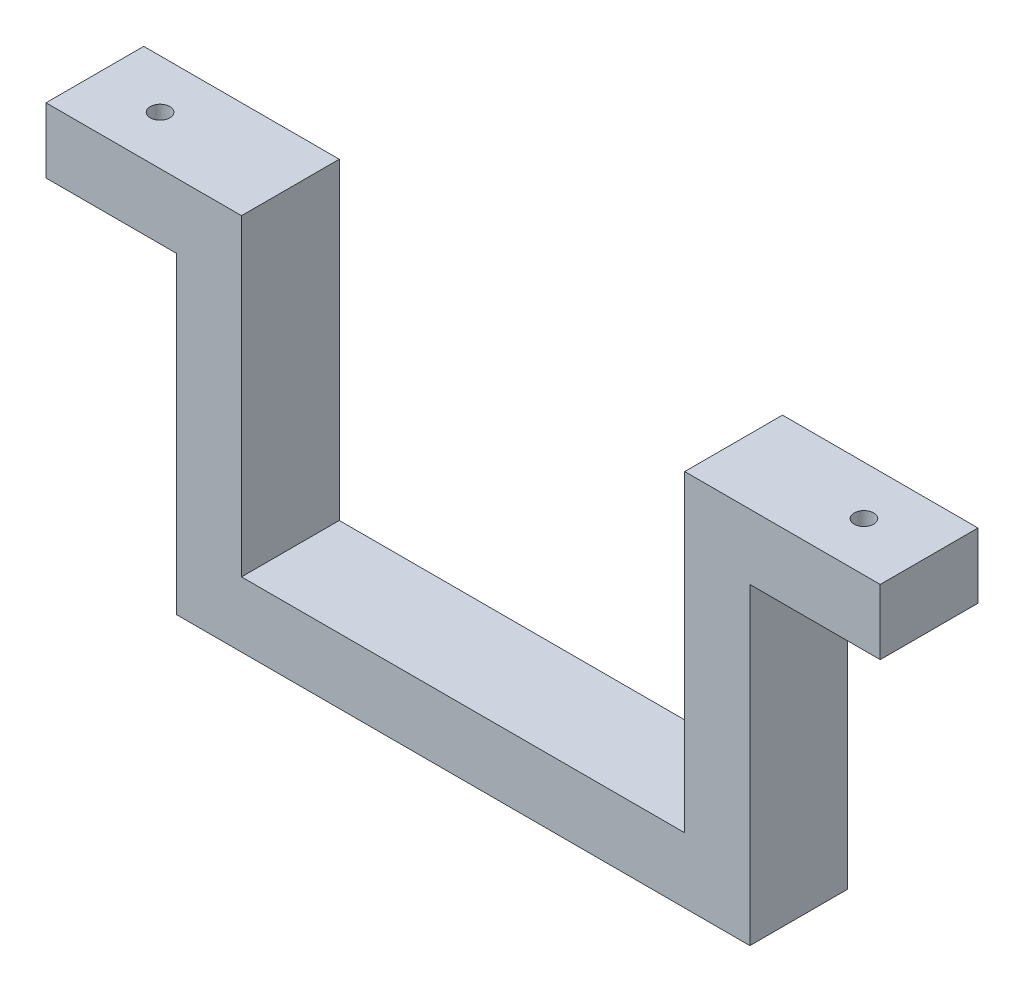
ISO-10303-21;
HEADER;
FILE_DESCRIPTION(('STEP AP214'),'2;1');
FILE_NAME('part.step','',(''),(''),'','','');
FILE_SCHEMA(('AUTOMOTIVE_DESIGN { 1 0 10303 214 1 1 1 1 }'));
ENDSEC;
DATA;
#1=APPLICATION_CONTEXT('core data for automotive mechanical design processes');
#2=APPLICATION_PROTOCOL_DEFINITION('international standard','automotive_design',2000,#1);
#3=PRODUCT_CONTEXT('',#1,'mechanical');
#4=PRODUCT('Part','Part','',(#3));
#5=PRODUCT_RELATED_PRODUCT_CATEGORY('part','',(#4));
#6=PRODUCT_DEFINITION_FORMATION('','',#4);
#7=PRODUCT_DEFINITION_CONTEXT('part definition',#1,'design');
#8=PRODUCT_DEFINITION('design','',#6,#7);
#9=PRODUCT_DEFINITION_SHAPE('','',#8);
#10=(LENGTH_UNIT() NAMED_UNIT(*) SI_UNIT(.MILLI.,.METRE.));
#11=(NAMED_UNIT(*) PLANE_ANGLE_UNIT() SI_UNIT($,.RADIAN.));
#12=(NAMED_UNIT(*) SI_UNIT($,.STERADIAN.) SOLID_ANGLE_UNIT());
#13=UNCERTAINTY_MEASURE_WITH_UNIT(LENGTH_MEASURE(1.E-05),#10,'distance_accuracy_value','');
#14=(GEOMETRIC_REPRESENTATION_CONTEXT(3) GLOBAL_UNCERTAINTY_ASSIGNED_CONTEXT((#13)) GLOBAL_UNIT_ASSIGNED_CONTEXT((#10,
#11,#12)) REPRESENTATION_CONTEXT('',''));
#15=CARTESIAN_POINT('',(0.,0.,0.));
#16=DIRECTION('',(0.,0.,1.));
#17=DIRECTION('',(1.,0.,0.));
#18=AXIS2_PLACEMENT_3D('',#15,#16,#17);
#19=CARTESIAN_POINT('',(0.,48.,15.));
#20=DIRECTION('',(1.,0.,0.));
#21=DIRECTION('',(0.,1.,0.));
#22=AXIS2_PLACEMENT_3D('',#19,#20,#21);
#23=PLANE('',#22);
#24=DIRECTION('',(0.,-1.,0.));
#25=VECTOR('',#24,1.);
#26=CARTESIAN_POINT('',(0.,48.,0.));
#27=LINE('',#26,#25);
#28=CARTESIAN_POINT('',(0.,48.,0.));
#29=VERTEX_POINT('',#28);
#30=CARTESIAN_POINT('',(0.,0.,0.));
#31=VERTEX_POINT('',#30);
#32=EDGE_CURVE('E155',#29,#31,#27,.T.);
#33=ORIENTED_EDGE('',*,*,#32,.T.);
#34=DIRECTION('',(0.,0.,-1.));
#35=VECTOR('',#34,1.);
#36=CARTESIAN_POINT('',(0.,0.,15.));
#37=LINE('',#36,#35);
#38=CARTESIAN_POINT('',(0.,0.,15.));
#39=VERTEX_POINT('',#38);
#40=EDGE_CURVE('E203',#39,#31,#37,.T.);
#41=ORIENTED_EDGE('',*,*,#40,.F.);
#42=DIRECTION('',(0.,-1.,0.));
#43=VECTOR('',#42,1.);
#44=CARTESIAN_POINT('',(0.,48.,15.));
#45=LINE('',#44,#43);
#46=CARTESIAN_POINT('',(0.,48.,15.));
#47=VERTEX_POINT('',#46);
#48=EDGE_CURVE('E178',#47,#39,#45,.T.);
#49=ORIENTED_EDGE('',*,*,#48,.F.);
#50=DIRECTION('',(0.,0.,-1.));
#51=VECTOR('',#50,1.);
#52=CARTESIAN_POINT('',(0.,48.,15.));
#53=LINE('',#52,#51);
#54=EDGE_CURVE('E151',#47,#29,#53,.T.);
#55=ORIENTED_EDGE('',*,*,#54,.T.);
#56=EDGE_LOOP('',(#33,#41,#49,#55));
#57=FACE_BOUND('',#56,.T.);
#58=ADVANCED_FACE('F33',(#57),#23,.F.);
#59=CARTESIAN_POINT('',(0.,0.,15.));
#60=DIRECTION('',(0.,1.,0.));
#61=DIRECTION('',(0.,0.,1.));
#62=AXIS2_PLACEMENT_3D('',#59,#60,#61);
#63=PLANE('',#62);
#64=DIRECTION('',(1.,0.,0.));
#65=VECTOR('',#64,1.);
#66=CARTESIAN_POINT('',(0.,0.,0.));
#67=LINE('',#66,#65);
#68=CARTESIAN_POINT('',(88.,0.,0.));
#69=VERTEX_POINT('',#68);
#70=EDGE_CURVE('E158',#31,#69,#67,.T.);
#71=ORIENTED_EDGE('',*,*,#70,.T.);
#72=DIRECTION('',(0.,0.,-1.));
#73=VECTOR('',#72,1.);
#74=CARTESIAN_POINT('',(88.,0.,15.));
#75=LINE('',#74,#73);
#76=CARTESIAN_POINT('',(88.,0.,15.));
#77=VERTEX_POINT('',#76);
#78=EDGE_CURVE('E200',#77,#69,#75,.T.);
#79=ORIENTED_EDGE('',*,*,#78,.F.);
#80=DIRECTION('',(1.,0.,0.));
#81=VECTOR('',#80,1.);
#82=CARTESIAN_POINT('',(0.,0.,15.));
#83=LINE('',#82,#81);
#84=EDGE_CURVE('E106',#39,#77,#83,.T.);
#85=ORIENTED_EDGE('',*,*,#84,.F.);
#86=ORIENTED_EDGE('',*,*,#40,.T.);
#87=EDGE_LOOP('',(#71,#79,#85,#86));
#88=FACE_BOUND('',#87,.T.);
#89=ADVANCED_FACE('F225',(#88),#63,.F.);
#90=CARTESIAN_POINT('',(88.,0.,15.));
#91=DIRECTION('',(-1.,0.,0.));
#92=DIRECTION('',(0.,0.,1.));
#93=AXIS2_PLACEMENT_3D('',#90,#91,#92);
#94=PLANE('',#93);
#95=DIRECTION('',(0.,1.,0.));
#96=VECTOR('',#95,1.);
#97=CARTESIAN_POINT('',(88.,0.,0.));
#98=LINE('',#97,#96);
#99=CARTESIAN_POINT('',(88.,48.,0.));
#100=VERTEX_POINT('',#99);
#101=EDGE_CURVE('E161',#69,#100,#98,.T.);
#102=ORIENTED_EDGE('',*,*,#101,.T.);
#103=DIRECTION('',(0.,0.,-1.));
#104=VECTOR('',#103,1.);
#105=CARTESIAN_POINT('',(88.,48.,15.));
#106=LINE('',#105,#104);
#107=CARTESIAN_POINT('',(88.,48.,15.));
#108=VERTEX_POINT('',#107);
#109=EDGE_CURVE('E197',#108,#100,#106,.T.);
#110=ORIENTED_EDGE('',*,*,#109,.F.);
#111=DIRECTION('',(0.,1.,0.));
#112=VECTOR('',#111,1.);
#113=CARTESIAN_POINT('',(88.,0.,15.));
#114=LINE('',#113,#112);
#115=EDGE_CURVE('E257',#77,#108,#114,.T.);
#116=ORIENTED_EDGE('',*,*,#115,.F.);
#117=ORIENTED_EDGE('',*,*,#78,.T.);
#118=EDGE_LOOP('',(#102,#110,#116,#117));
#119=FACE_BOUND('',#118,.T.);
#120=ADVANCED_FACE('F231',(#119),#94,.F.);
#121=CARTESIAN_POINT('',(88.,48.,15.));
#122=DIRECTION('',(0.,1.,0.));
#123=DIRECTION('',(0.,0.,1.));
#124=AXIS2_PLACEMENT_3D('',#121,#122,#123);
#125=PLANE('',#124);
#126=CARTESIAN_POINT('',(98.,48.,7.5));
#127=DIRECTION('',(0.,1.,0.));
#128=DIRECTION('',(0.,0.,1.));
#129=AXIS2_PLACEMENT_3D('',#126,#127,#128);
#130=CIRCLE('',#129,4.50000000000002);
#131=CARTESIAN_POINT('',(98.,48.,2.99999999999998));
#132=VERTEX_POINT('',#131);
#133=EDGE_CURVE('E208',#132,#132,#130,.T.);
#134=ORIENTED_EDGE('',*,*,#133,.T.);
#135=EDGE_LOOP('',(#134));
#136=FACE_BOUND('',#135,.T.);
#137=DIRECTION('',(1.,0.,0.));
#138=VECTOR('',#137,1.);
#139=CARTESIAN_POINT('',(88.,48.,0.));
#140=LINE('',#139,#138);
#141=CARTESIAN_POINT('',(108.,48.,0.));
#142=VERTEX_POINT('',#141);
#143=EDGE_CURVE('E163',#100,#142,#140,.T.);
#144=ORIENTED_EDGE('',*,*,#143,.T.);
#145=DIRECTION('',(0.,0.,-1.));
#146=VECTOR('',#145,1.);
#147=CARTESIAN_POINT('',(108.,48.,15.));
#148=LINE('',#147,#146);
#149=CARTESIAN_POINT('',(108.,48.,15.));
#150=VERTEX_POINT('',#149);
#151=EDGE_CURVE('E194',#150,#142,#148,.T.);
#152=ORIENTED_EDGE('',*,*,#151,.F.);
#153=DIRECTION('',(1.,0.,0.));
#154=VECTOR('',#153,1.);
#155=CARTESIAN_POINT('',(88.,48.,15.));
#156=LINE('',#155,#154);
#157=EDGE_CURVE('E259',#108,#150,#156,.T.);
#158=ORIENTED_EDGE('',*,*,#157,.F.);
#159=ORIENTED_EDGE('',*,*,#109,.T.);
#160=EDGE_LOOP('',(#144,#152,#158,#159));
#161=FACE_BOUND('',#160,.T.);
#162=ADVANCED_FACE('F312',(#136,#161),#125,.F.);
#163=CARTESIAN_POINT('',(108.,48.,15.));
#164=DIRECTION('',(-1.,0.,0.));
#165=DIRECTION('',(0.,0.,1.));
#166=AXIS2_PLACEMENT_3D('',#163,#164,#165);
#167=PLANE('',#166);
#168=DIRECTION('',(0.,1.,0.));
#169=VECTOR('',#168,1.);
#170=CARTESIAN_POINT('',(108.,48.,0.));
#171=LINE('',#170,#169);
#172=CARTESIAN_POINT('',(108.,58.,0.));
#173=VERTEX_POINT('',#172);
#174=EDGE_CURVE('E165',#142,#173,#171,.T.);
#175=ORIENTED_EDGE('',*,*,#174,.T.);
#176=DIRECTION('',(0.,0.,-1.));
#177=VECTOR('',#176,1.);
#178=CARTESIAN_POINT('',(108.,58.,15.));
#179=LINE('',#178,#177);
#180=CARTESIAN_POINT('',(108.,58.,15.));
#181=VERTEX_POINT('',#180);
#182=EDGE_CURVE('E191',#181,#173,#179,.T.);
#183=ORIENTED_EDGE('',*,*,#182,.F.);
#184=DIRECTION('',(0.,1.,0.));
#185=VECTOR('',#184,1.);
#186=CARTESIAN_POINT('',(108.,48.,15.));
#187=LINE('',#186,#185);
#188=EDGE_CURVE('E261',#150,#181,#187,.T.);
#189=ORIENTED_EDGE('',*,*,#188,.F.);
#190=ORIENTED_EDGE('',*,*,#151,.T.);
#191=EDGE_LOOP('',(#175,#183,#189,#190));
#192=FACE_BOUND('',#191,.T.);
#193=ADVANCED_FACE('F309',(#192),#167,.F.);
#194=CARTESIAN_POINT('',(108.,58.,15.));
#195=DIRECTION('',(0.,-1.,0.));
#196=DIRECTION('',(1.,0.,0.));
#197=AXIS2_PLACEMENT_3D('',#194,#195,#196);
#198=PLANE('',#197);
#199=CARTESIAN_POINT('',(98.,58.,7.5));
#200=DIRECTION('',(0.,-1.,0.));
#201=DIRECTION('',(0.,0.,-1.));
#202=AXIS2_PLACEMENT_3D('',#199,#200,#201);
#203=CIRCLE('',#202,1.5);
#204=CARTESIAN_POINT('',(98.,58.,6.));
#205=VERTEX_POINT('',#204);
#206=EDGE_CURVE('E159',#205,#205,#203,.T.);
#207=ORIENTED_EDGE('',*,*,#206,.T.);
#208=EDGE_LOOP('',(#207));
#209=FACE_BOUND('',#208,.T.);
#210=DIRECTION('',(-1.,0.,0.));
#211=VECTOR('',#210,1.);
#212=CARTESIAN_POINT('',(108.,58.,0.));
#213=LINE('',#212,#211);
#214=CARTESIAN_POINT('',(78.,58.,0.));
#215=VERTEX_POINT('',#214);
#216=EDGE_CURVE('E167',#173,#215,#213,.T.);
#217=ORIENTED_EDGE('',*,*,#216,.T.);
#218=DIRECTION('',(0.,0.,-1.));
#219=VECTOR('',#218,1.);
#220=CARTESIAN_POINT('',(78.,58.,15.));
#221=LINE('',#220,#219);
#222=CARTESIAN_POINT('',(78.,58.,15.));
#223=VERTEX_POINT('',#222);
#224=EDGE_CURVE('E188',#223,#215,#221,.T.);
#225=ORIENTED_EDGE('',*,*,#224,.F.);
#226=DIRECTION('',(-1.,0.,0.));
#227=VECTOR('',#226,1.);
#228=CARTESIAN_POINT('',(108.,58.,15.));
#229=LINE('',#228,#227);
#230=EDGE_CURVE('E263',#181,#223,#229,.T.);
#231=ORIENTED_EDGE('',*,*,#230,.F.);
#232=ORIENTED_EDGE('',*,*,#182,.T.);
#233=EDGE_LOOP('',(#217,#225,#231,#232));
#234=FACE_BOUND('',#233,.T.);
#235=ADVANCED_FACE('F305',(#209,#234),#198,.F.);
#236=CARTESIAN_POINT('',(78.,58.,15.));
#237=DIRECTION('',(1.,0.,0.));
#238=DIRECTION('',(0.,0.,-1.));
#239=AXIS2_PLACEMENT_3D('',#236,#237,#238);
#240=PLANE('',#239);
#241=DIRECTION('',(0.,-1.,0.));
#242=VECTOR('',#241,1.);
#243=CARTESIAN_POINT('',(78.,58.,0.));
#244=LINE('',#243,#242);
#245=CARTESIAN_POINT('',(78.,10.,0.));
#246=VERTEX_POINT('',#245);
#247=EDGE_CURVE('E169',#215,#246,#244,.T.);
#248=ORIENTED_EDGE('',*,*,#247,.T.);
#249=DIRECTION('',(0.,0.,-1.));
#250=VECTOR('',#249,1.);
#251=CARTESIAN_POINT('',(78.,10.,15.));
#252=LINE('',#251,#250);
#253=CARTESIAN_POINT('',(78.,10.,15.));
#254=VERTEX_POINT('',#253);
#255=EDGE_CURVE('E185',#254,#246,#252,.T.);
#256=ORIENTED_EDGE('',*,*,#255,.F.);
#257=DIRECTION('',(0.,-1.,0.));
#258=VECTOR('',#257,1.);
#259=CARTESIAN_POINT('',(78.,58.,15.));
#260=LINE('',#259,#258);
#261=EDGE_CURVE('E265',#223,#254,#260,.T.);
#262=ORIENTED_EDGE('',*,*,#261,.F.);
#263=ORIENTED_EDGE('',*,*,#224,.T.);
#264=EDGE_LOOP('',(#248,#256,#262,#263));
#265=FACE_BOUND('',#264,.T.);
#266=ADVANCED_FACE('F302',(#265),#240,.F.);
#267=CARTESIAN_POINT('',(78.,10.,15.));
#268=DIRECTION('',(0.,-1.,0.));
#269=DIRECTION('',(1.,0.,0.));
#270=AXIS2_PLACEMENT_3D('',#267,#268,#269);
#271=PLANE('',#270);
#272=DIRECTION('',(-1.,0.,0.));
#273=VECTOR('',#272,1.);
#274=CARTESIAN_POINT('',(78.,10.,0.));
#275=LINE('',#274,#273);
#276=CARTESIAN_POINT('',(10.,9.99999999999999,0.));
#277=VERTEX_POINT('',#276);
#278=EDGE_CURVE('E171',#246,#277,#275,.T.);
#279=ORIENTED_EDGE('',*,*,#278,.T.);
#280=DIRECTION('',(0.,0.,-1.));
#281=VECTOR('',#280,1.);
#282=CARTESIAN_POINT('',(10.,9.99999999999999,15.));
#283=LINE('',#282,#281);
#284=CARTESIAN_POINT('',(10.,9.99999999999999,15.));
#285=VERTEX_POINT('',#284);
#286=EDGE_CURVE('E182',#285,#277,#283,.T.);
#287=ORIENTED_EDGE('',*,*,#286,.F.);
#288=DIRECTION('',(-1.,0.,0.));
#289=VECTOR('',#288,1.);
#290=CARTESIAN_POINT('',(78.,10.,15.));
#291=LINE('',#290,#289);
#292=EDGE_CURVE('E267',#254,#285,#291,.T.);
#293=ORIENTED_EDGE('',*,*,#292,.F.);
#294=ORIENTED_EDGE('',*,*,#255,.T.);
#295=EDGE_LOOP('',(#279,#287,#293,#294));
#296=FACE_BOUND('',#295,.T.);
#297=ADVANCED_FACE('F273',(#296),#271,.F.);
#298=CARTESIAN_POINT('',(10.,9.99999999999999,15.));
#299=DIRECTION('',(-1.,0.,0.));
#300=DIRECTION('',(0.,0.,1.));
#301=AXIS2_PLACEMENT_3D('',#298,#299,#300);
#302=PLANE('',#301);
#303=DIRECTION('',(0.,1.,0.));
#304=VECTOR('',#303,1.);
#305=CARTESIAN_POINT('',(10.,9.99999999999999,0.));
#306=LINE('',#305,#304);
#307=CARTESIAN_POINT('',(10.,58.,0.));
#308=VERTEX_POINT('',#307);
#309=EDGE_CURVE('E173',#277,#308,#306,.T.);
#310=ORIENTED_EDGE('',*,*,#309,.T.);
#311=DIRECTION('',(0.,0.,-1.));
#312=VECTOR('',#311,1.);
#313=CARTESIAN_POINT('',(10.,58.,15.));
#314=LINE('',#313,#312);
#315=CARTESIAN_POINT('',(10.,58.,15.));
#316=VERTEX_POINT('',#315);
#317=EDGE_CURVE('E146',#316,#308,#314,.T.);
#318=ORIENTED_EDGE('',*,*,#317,.F.);
#319=DIRECTION('',(0.,1.,0.));
#320=VECTOR('',#319,1.);
#321=CARTESIAN_POINT('',(10.,9.99999999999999,15.));
#322=LINE('',#321,#320);
#323=EDGE_CURVE('E137',#285,#316,#322,.T.);
#324=ORIENTED_EDGE('',*,*,#323,.F.);
#325=ORIENTED_EDGE('',*,*,#286,.T.);
#326=EDGE_LOOP('',(#310,#318,#324,#325));
#327=FACE_BOUND('',#326,.T.);
#328=ADVANCED_FACE('F277',(#327),#302,.F.);
#329=CARTESIAN_POINT('',(10.,58.,15.));
#330=DIRECTION('',(0.,-1.,0.));
#331=DIRECTION('',(1.,0.,0.));
#332=AXIS2_PLACEMENT_3D('',#329,#330,#331);
#333=PLANE('',#332);
#334=CARTESIAN_POINT('',(-10.,58.,7.5));
#335=DIRECTION('',(0.,-1.,0.));
#336=DIRECTION('',(0.,0.,-1.));
#337=AXIS2_PLACEMENT_3D('',#334,#335,#336);
#338=CIRCLE('',#337,1.5);
#339=CARTESIAN_POINT('',(-10.,58.,6.));
#340=VERTEX_POINT('',#339);
#341=EDGE_CURVE('E250',#340,#340,#338,.T.);
#342=ORIENTED_EDGE('',*,*,#341,.T.);
#343=EDGE_LOOP('',(#342));
#344=FACE_BOUND('',#343,.T.);
#345=DIRECTION('',(-1.,0.,0.));
#346=VECTOR('',#345,1.);
#347=CARTESIAN_POINT('',(10.,58.,0.));
#348=LINE('',#347,#346);
#349=CARTESIAN_POINT('',(-20.,58.,0.));
#350=VERTEX_POINT('',#349);
#351=EDGE_CURVE('E145',#308,#350,#348,.T.);
#352=ORIENTED_EDGE('',*,*,#351,.T.);
#353=DIRECTION('',(0.,0.,-1.));
#354=VECTOR('',#353,1.);
#355=CARTESIAN_POINT('',(-20.,58.,15.));
#356=LINE('',#355,#354);
#357=CARTESIAN_POINT('',(-20.,58.,15.));
#358=VERTEX_POINT('',#357);
#359=EDGE_CURVE('E142',#358,#350,#356,.T.);
#360=ORIENTED_EDGE('',*,*,#359,.F.);
#361=DIRECTION('',(-1.,0.,0.));
#362=VECTOR('',#361,1.);
#363=CARTESIAN_POINT('',(10.,58.,15.));
#364=LINE('',#363,#362);
#365=EDGE_CURVE('E131',#316,#358,#364,.T.);
#366=ORIENTED_EDGE('',*,*,#365,.F.);
#367=ORIENTED_EDGE('',*,*,#317,.T.);
#368=EDGE_LOOP('',(#352,#360,#366,#367));
#369=FACE_BOUND('',#368,.T.);
#370=ADVANCED_FACE('F143',(#344,#369),#333,.F.);
#371=CARTESIAN_POINT('',(-20.,58.,15.));
#372=DIRECTION('',(1.,0.,0.));
#373=DIRECTION('',(0.,0.,-1.));
#374=AXIS2_PLACEMENT_3D('',#371,#372,#373);
#375=PLANE('',#374);
#376=DIRECTION('',(0.,-1.,0.));
#377=VECTOR('',#376,1.);
#378=CARTESIAN_POINT('',(-20.,58.,0.));
#379=LINE('',#378,#377);
#380=CARTESIAN_POINT('',(-20.,48.,0.));
#381=VERTEX_POINT('',#380);
#382=EDGE_CURVE('E91',#350,#381,#379,.T.);
#383=ORIENTED_EDGE('',*,*,#382,.T.);
#384=DIRECTION('',(0.,0.,-1.));
#385=VECTOR('',#384,1.);
#386=CARTESIAN_POINT('',(-20.,48.,15.));
#387=LINE('',#386,#385);
#388=CARTESIAN_POINT('',(-20.,48.,15.));
#389=VERTEX_POINT('',#388);
#390=EDGE_CURVE('E147',#389,#381,#387,.T.);
#391=ORIENTED_EDGE('',*,*,#390,.F.);
#392=DIRECTION('',(0.,-1.,0.));
#393=VECTOR('',#392,1.);
#394=CARTESIAN_POINT('',(-20.,58.,15.));
#395=LINE('',#394,#393);
#396=EDGE_CURVE('E135',#358,#389,#395,.T.);
#397=ORIENTED_EDGE('',*,*,#396,.F.);
#398=ORIENTED_EDGE('',*,*,#359,.T.);
#399=EDGE_LOOP('',(#383,#391,#397,#398));
#400=FACE_BOUND('',#399,.T.);
#401=ADVANCED_FACE('F149',(#400),#375,.F.);
#402=CARTESIAN_POINT('',(-20.,48.,15.));
#403=DIRECTION('',(0.,1.,0.));
#404=DIRECTION('',(0.,0.,1.));
#405=AXIS2_PLACEMENT_3D('',#402,#403,#404);
#406=PLANE('',#405);
#407=CARTESIAN_POINT('',(-10.,48.,7.5));
#408=DIRECTION('',(0.,1.,0.));
#409=DIRECTION('',(0.,0.,1.));
#410=AXIS2_PLACEMENT_3D('',#407,#408,#409);
#411=CIRCLE('',#410,4.5);
#412=CARTESIAN_POINT('',(-10.,48.,2.99999999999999));
#413=VERTEX_POINT('',#412);
#414=EDGE_CURVE('E11',#413,#413,#411,.T.);
#415=ORIENTED_EDGE('',*,*,#414,.T.);
#416=EDGE_LOOP('',(#415));
#417=FACE_BOUND('',#416,.T.);
#418=DIRECTION('',(1.,0.,0.));
#419=VECTOR('',#418,1.);
#420=CARTESIAN_POINT('',(-20.,48.,0.));
#421=LINE('',#420,#419);
#422=EDGE_CURVE('E97',#381,#29,#421,.T.);
#423=ORIENTED_EDGE('',*,*,#422,.T.);
#424=ORIENTED_EDGE('',*,*,#54,.F.);
#425=DIRECTION('',(1.,0.,0.));
#426=VECTOR('',#425,1.);
#427=CARTESIAN_POINT('',(-20.,48.,15.));
#428=LINE('',#427,#426);
#429=EDGE_CURVE('E50',#389,#47,#428,.T.);
#430=ORIENTED_EDGE('',*,*,#429,.F.);
#431=ORIENTED_EDGE('',*,*,#390,.T.);
#432=EDGE_LOOP('',(#423,#424,#430,#431));
#433=FACE_BOUND('',#432,.T.);
#434=ADVANCED_FACE('F283',(#417,#433),#406,.F.);
#435=CARTESIAN_POINT('',(0.,0.,15.));
#436=DIRECTION('',(0.,0.,1.));
#437=DIRECTION('',(1.,0.,0.));
#438=AXIS2_PLACEMENT_3D('',#435,#436,#437);
#439=PLANE('',#438);
#440=ORIENTED_EDGE('',*,*,#48,.T.);
#441=ORIENTED_EDGE('',*,*,#84,.T.);
#442=ORIENTED_EDGE('',*,*,#115,.T.);
#443=ORIENTED_EDGE('',*,*,#157,.T.);
#444=ORIENTED_EDGE('',*,*,#188,.T.);
#445=ORIENTED_EDGE('',*,*,#230,.T.);
#446=ORIENTED_EDGE('',*,*,#261,.T.);
#447=ORIENTED_EDGE('',*,*,#292,.T.);
#448=ORIENTED_EDGE('',*,*,#323,.T.);
#449=ORIENTED_EDGE('',*,*,#365,.T.);
#450=ORIENTED_EDGE('',*,*,#396,.T.);
#451=ORIENTED_EDGE('',*,*,#429,.T.);
#452=EDGE_LOOP('',(#440,#441,#442,#443,#444,#445,#446,#447,#448,#449,#450,#451));
#453=FACE_BOUND('',#452,.T.);
#454=ADVANCED_FACE('F133',(#453),#439,.T.);
#455=CARTESIAN_POINT('',(0.,0.,0.));
#456=DIRECTION('',(0.,0.,1.));
#457=DIRECTION('',(1.,0.,0.));
#458=AXIS2_PLACEMENT_3D('',#455,#456,#457);
#459=PLANE('',#458);
#460=ORIENTED_EDGE('',*,*,#32,.F.);
#461=ORIENTED_EDGE('',*,*,#422,.F.);
#462=ORIENTED_EDGE('',*,*,#382,.F.);
#463=ORIENTED_EDGE('',*,*,#351,.F.);
#464=ORIENTED_EDGE('',*,*,#309,.F.);
#465=ORIENTED_EDGE('',*,*,#278,.F.);
#466=ORIENTED_EDGE('',*,*,#247,.F.);
#467=ORIENTED_EDGE('',*,*,#216,.F.);
#468=ORIENTED_EDGE('',*,*,#174,.F.);
#469=ORIENTED_EDGE('',*,*,#143,.F.);
#470=ORIENTED_EDGE('',*,*,#101,.F.);
#471=ORIENTED_EDGE('',*,*,#70,.F.);
#472=EDGE_LOOP('',(#460,#461,#462,#463,#464,#465,#466,#467,#468,#469,#470,#471));
#473=FACE_BOUND('',#472,.T.);
#474=ADVANCED_FACE('F240',(#473),#459,.F.);
#475=CARTESIAN_POINT('',(98.,58.,7.5));
#476=DIRECTION('',(0.,-1.,0.));
#477=DIRECTION('',(0.,0.,-1.));
#478=AXIS2_PLACEMENT_3D('',#475,#476,#477);
#479=CYLINDRICAL_SURFACE('',#478,1.5);
#480=CARTESIAN_POINT('',(98.,51.,7.5));
#481=DIRECTION('',(0.,1.,0.));
#482=DIRECTION('',(0.,0.,1.));
#483=AXIS2_PLACEMENT_3D('',#480,#481,#482);
#484=CIRCLE('',#483,1.5);
#485=CARTESIAN_POINT('',(98.,51.,6.));
#486=VERTEX_POINT('',#485);
#487=EDGE_CURVE('E205',#486,#486,#484,.F.);
#488=ORIENTED_EDGE('',*,*,#487,.T.);
#489=EDGE_LOOP('',(#488));
#490=FACE_BOUND('',#489,.T.);
#491=ORIENTED_EDGE('',*,*,#206,.F.);
#492=EDGE_LOOP('',(#491));
#493=FACE_BOUND('',#492,.T.);
#494=ADVANCED_FACE('F235',(#490,#493),#479,.F.);
#495=CARTESIAN_POINT('',(98.,51.,7.5));
#496=DIRECTION('',(0.,-1.,0.));
#497=DIRECTION('',(0.,0.,-1.));
#498=AXIS2_PLACEMENT_3D('',#495,#496,#497);
#499=CONICAL_SURFACE('',#498,1.5,0.785398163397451);
#500=CARTESIAN_POINT('',(98.,48.,2.99999999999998));
#501=CARTESIAN_POINT('',(98.,48.03125,3.03124999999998));
#502=CARTESIAN_POINT('',(98.,48.0625,3.06249999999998));
#503=CARTESIAN_POINT('',(98.,48.125,3.12499999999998));
#504=CARTESIAN_POINT('',(98.,48.15625,3.15624999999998));
#505=CARTESIAN_POINT('',(98.,48.21875,3.21874999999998));
#506=CARTESIAN_POINT('',(98.,48.25,3.24999999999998));
#507=CARTESIAN_POINT('',(98.,48.3125,3.31249999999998));
#508=CARTESIAN_POINT('',(98.,48.34375,3.34374999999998));
#509=CARTESIAN_POINT('',(98.,48.40625,3.40624999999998));
#510=CARTESIAN_POINT('',(98.,48.4375,3.43749999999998));
#511=CARTESIAN_POINT('',(98.,48.5,3.49999999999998));
#512=CARTESIAN_POINT('',(98.,48.53125,3.53124999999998));
#513=CARTESIAN_POINT('',(98.,48.59375,3.59374999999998));
#514=CARTESIAN_POINT('',(98.,48.625,3.62499999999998));
#515=CARTESIAN_POINT('',(98.,48.6875,3.68749999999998));
#516=CARTESIAN_POINT('',(98.,48.71875,3.71874999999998));
#517=CARTESIAN_POINT('',(98.,48.78125,3.78124999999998));
#518=CARTESIAN_POINT('',(98.,48.8125,3.81249999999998));
#519=CARTESIAN_POINT('',(98.,48.875,3.87499999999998));
#520=CARTESIAN_POINT('',(98.,48.90625,3.90624999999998));
#521=CARTESIAN_POINT('',(98.,48.96875,3.96874999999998));
#522=CARTESIAN_POINT('',(98.,49.,3.99999999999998));
#523=CARTESIAN_POINT('',(98.,49.0625,4.06249999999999));
#524=CARTESIAN_POINT('',(98.,49.09375,4.09374999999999));
#525=CARTESIAN_POINT('',(98.,49.15625,4.15624999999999));
#526=CARTESIAN_POINT('',(98.,49.1875,4.18749999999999));
#527=CARTESIAN_POINT('',(98.,49.25,4.24999999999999));
#528=CARTESIAN_POINT('',(98.,49.28125,4.28124999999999));
#529=CARTESIAN_POINT('',(98.,49.34375,4.34374999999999));
#530=CARTESIAN_POINT('',(98.,49.375,4.37499999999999));
#531=CARTESIAN_POINT('',(98.,49.4375,4.43749999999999));
#532=CARTESIAN_POINT('',(98.,49.46875,4.46874999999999));
#533=CARTESIAN_POINT('',(98.,49.53125,4.53124999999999));
#534=CARTESIAN_POINT('',(98.,49.5625,4.56249999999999));
#535=CARTESIAN_POINT('',(98.,49.625,4.62499999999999));
#536=CARTESIAN_POINT('',(98.,49.65625,4.65624999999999));
#537=CARTESIAN_POINT('',(98.,49.71875,4.71874999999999));
#538=CARTESIAN_POINT('',(98.,49.75,4.74999999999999));
#539=CARTESIAN_POINT('',(98.,49.8125,4.81249999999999));
#540=CARTESIAN_POINT('',(98.,49.84375,4.84374999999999));
#541=CARTESIAN_POINT('',(98.,49.90625,4.90624999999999));
#542=CARTESIAN_POINT('',(98.,49.9375,4.93749999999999));
#543=CARTESIAN_POINT('',(98.,50.,4.99999999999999));
#544=CARTESIAN_POINT('',(98.,50.03125,5.03124999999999));
#545=CARTESIAN_POINT('',(98.,50.09375,5.09374999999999));
#546=CARTESIAN_POINT('',(98.,50.125,5.12499999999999));
#547=CARTESIAN_POINT('',(98.,50.1875,5.18749999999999));
#548=CARTESIAN_POINT('',(98.,50.21875,5.21874999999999));
#549=CARTESIAN_POINT('',(98.,50.28125,5.28125));
#550=CARTESIAN_POINT('',(98.,50.3125,5.31249999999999));
#551=CARTESIAN_POINT('',(98.,50.375,5.37499999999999));
#552=CARTESIAN_POINT('',(98.,50.40625,5.40624999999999));
#553=CARTESIAN_POINT('',(98.,50.46875,5.46874999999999));
#554=CARTESIAN_POINT('',(98.,50.5,5.49999999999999));
#555=CARTESIAN_POINT('',(98.,50.5625,5.5625));
#556=CARTESIAN_POINT('',(98.,50.59375,5.59375));
#557=CARTESIAN_POINT('',(98.,50.65625,5.65625));
#558=CARTESIAN_POINT('',(98.,50.6875,5.6875));
#559=CARTESIAN_POINT('',(98.,50.75,5.75));
#560=CARTESIAN_POINT('',(98.,50.78125,5.78125));
#561=CARTESIAN_POINT('',(98.,50.84375,5.84375));
#562=CARTESIAN_POINT('',(98.,50.875,5.875));
#563=CARTESIAN_POINT('',(98.,50.9375,5.9375));
#564=CARTESIAN_POINT('',(98.,50.96875,5.96875));
#565=CARTESIAN_POINT('',(98.,51.,6.));
#566=B_SPLINE_CURVE_WITH_KNOTS('',3,(#500,#501,#502,#503,#504,#505,#506,#507,#508,#509,#510,
#511,#512,#513,#514,#515,#516,#517,#518,#519,#520,#521,#522,#523,#524,#525,#526,#527,#528,#529,
#530,#531,#532,#533,#534,#535,#536,#537,#538,#539,#540,#541,#542,#543,#544,#545,#546,#547,#548,
#549,#550,#551,#552,#553,#554,#555,#556,#557,#558,#559,#560,#561,#562,#563,#564,#565),
.UNSPECIFIED.,.F.,.F.,(4,2,2,2,2,2,2,2,2,2,2,2,2,2,2,2,2,2,2,2,2,2,2,2,2,2,2,2,2,2,2,2,4),(0.,
0.13258252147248,0.265165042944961,0.397747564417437,0.530330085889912,0.662912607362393,
0.795495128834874,0.92807765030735,1.06066017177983,1.19324269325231,1.32582521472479,
1.45840773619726,1.59099025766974,1.72357277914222,1.8561553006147,1.98873782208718,
2.12132034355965,2.25390286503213,2.38648538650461,2.51906790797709,2.65165042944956,
2.78423295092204,2.91681547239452,3.049397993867,3.18198051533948,3.31456303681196,
3.44714555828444,3.57972807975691,3.71231060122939,3.84489312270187,3.97747564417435,
4.11005816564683,4.2426406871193),.UNSPECIFIED.);
#567=EDGE_CURVE('BSEAM221',#132,#486,#566,.T.);
#568=ORIENTED_EDGE('',*,*,#133,.F.);
#569=ORIENTED_EDGE('',*,*,#487,.F.);
#570=ORIENTED_EDGE('',*,*,#567,.T.);
#571=ORIENTED_EDGE('',*,*,#567,.F.);
#572=EDGE_LOOP('',(#568,#570,#569,#571));
#573=FACE_BOUND('',#572,.T.);
#574=ADVANCED_FACE('F221',(#573),#499,.F.);
#575=CARTESIAN_POINT('',(-10.,58.,7.5));
#576=DIRECTION('',(0.,-1.,0.));
#577=DIRECTION('',(0.,0.,-1.));
#578=AXIS2_PLACEMENT_3D('',#575,#576,#577);
#579=CYLINDRICAL_SURFACE('',#578,1.5);
#580=CARTESIAN_POINT('',(-10.,51.,7.5));
#581=DIRECTION('',(0.,1.,0.));
#582=DIRECTION('',(0.,0.,1.));
#583=AXIS2_PLACEMENT_3D('',#580,#581,#582);
#584=CIRCLE('',#583,1.5);
#585=CARTESIAN_POINT('',(-10.,51.,6.));
#586=VERTEX_POINT('',#585);
#587=EDGE_CURVE('E42',#586,#586,#584,.F.);
#588=ORIENTED_EDGE('',*,*,#587,.T.);
#589=EDGE_LOOP('',(#588));
#590=FACE_BOUND('',#589,.T.);
#591=ORIENTED_EDGE('',*,*,#341,.F.);
#592=EDGE_LOOP('',(#591));
#593=FACE_BOUND('',#592,.T.);
#594=ADVANCED_FACE('F213',(#590,#593),#579,.F.);
#595=CARTESIAN_POINT('',(-10.,51.,7.5));
#596=DIRECTION('',(0.,-1.,0.));
#597=DIRECTION('',(0.,0.,-1.));
#598=AXIS2_PLACEMENT_3D('',#595,#596,#597);
#599=CONICAL_SURFACE('',#598,1.5,0.785398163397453);
#600=CARTESIAN_POINT('',(-10.,48.,2.99999999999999));
#601=CARTESIAN_POINT('',(-10.,48.03125,3.03124999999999));
#602=CARTESIAN_POINT('',(-10.,48.0625,3.06249999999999));
#603=CARTESIAN_POINT('',(-10.,48.125,3.12499999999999));
#604=CARTESIAN_POINT('',(-10.,48.15625,3.15624999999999));
#605=CARTESIAN_POINT('',(-10.,48.21875,3.21874999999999));
#606=CARTESIAN_POINT('',(-10.,48.25,3.24999999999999));
#607=CARTESIAN_POINT('',(-10.,48.3125,3.31249999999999));
#608=CARTESIAN_POINT('',(-10.,48.34375,3.34374999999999));
#609=CARTESIAN_POINT('',(-10.,48.40625,3.40624999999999));
#610=CARTESIAN_POINT('',(-10.,48.4375,3.43749999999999));
#611=CARTESIAN_POINT('',(-10.,48.5,3.49999999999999));
#612=CARTESIAN_POINT('',(-10.,48.53125,3.53124999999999));
#613=CARTESIAN_POINT('',(-10.,48.59375,3.59374999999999));
#614=CARTESIAN_POINT('',(-10.,48.625,3.62499999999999));
#615=CARTESIAN_POINT('',(-10.,48.6875,3.68749999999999));
#616=CARTESIAN_POINT('',(-10.,48.71875,3.71874999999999));
#617=CARTESIAN_POINT('',(-10.,48.78125,3.78124999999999));
#618=CARTESIAN_POINT('',(-10.,48.8125,3.81249999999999));
#619=CARTESIAN_POINT('',(-10.,48.875,3.87499999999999));
#620=CARTESIAN_POINT('',(-10.,48.90625,3.90624999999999));
#621=CARTESIAN_POINT('',(-10.,48.96875,3.96874999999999));
#622=CARTESIAN_POINT('',(-10.,49.,3.99999999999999));
#623=CARTESIAN_POINT('',(-10.,49.0625,4.06249999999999));
#624=CARTESIAN_POINT('',(-10.,49.09375,4.09374999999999));
#625=CARTESIAN_POINT('',(-10.,49.15625,4.15624999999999));
#626=CARTESIAN_POINT('',(-10.,49.1875,4.18749999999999));
#627=CARTESIAN_POINT('',(-10.,49.25,4.24999999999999));
#628=CARTESIAN_POINT('',(-10.,49.28125,4.28124999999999));
#629=CARTESIAN_POINT('',(-10.,49.34375,4.34374999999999));
#630=CARTESIAN_POINT('',(-10.,49.375,4.37499999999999));
#631=CARTESIAN_POINT('',(-10.,49.4375,4.43749999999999));
#632=CARTESIAN_POINT('',(-10.,49.46875,4.46875));
#633=CARTESIAN_POINT('',(-10.,49.53125,4.53124999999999));
#634=CARTESIAN_POINT('',(-10.,49.5625,4.56249999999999));
#635=CARTESIAN_POINT('',(-10.,49.625,4.62499999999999));
#636=CARTESIAN_POINT('',(-10.,49.65625,4.65625));
#637=CARTESIAN_POINT('',(-10.,49.71875,4.71875));
#638=CARTESIAN_POINT('',(-10.,49.75,4.75));
#639=CARTESIAN_POINT('',(-10.,49.8125,4.81249999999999));
#640=CARTESIAN_POINT('',(-10.,49.84375,4.84375));
#641=CARTESIAN_POINT('',(-10.,49.90625,4.90625));
#642=CARTESIAN_POINT('',(-10.,49.9375,4.9375));
#643=CARTESIAN_POINT('',(-10.,50.,5.));
#644=CARTESIAN_POINT('',(-10.,50.03125,5.03124999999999));
#645=CARTESIAN_POINT('',(-10.,50.09375,5.09374999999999));
#646=CARTESIAN_POINT('',(-10.,50.125,5.125));
#647=CARTESIAN_POINT('',(-10.,50.1875,5.1875));
#648=CARTESIAN_POINT('',(-10.,50.21875,5.21875));
#649=CARTESIAN_POINT('',(-10.,50.28125,5.28125));
#650=CARTESIAN_POINT('',(-10.,50.3125,5.3125));
#651=CARTESIAN_POINT('',(-10.,50.375,5.375));
#652=CARTESIAN_POINT('',(-10.,50.40625,5.40625));
#653=CARTESIAN_POINT('',(-10.,50.46875,5.46875));
#654=CARTESIAN_POINT('',(-10.,50.5,5.5));
#655=CARTESIAN_POINT('',(-10.,50.5625,5.5625));
#656=CARTESIAN_POINT('',(-10.,50.59375,5.59375));
#657=CARTESIAN_POINT('',(-10.,50.65625,5.65625));
#658=CARTESIAN_POINT('',(-10.,50.6875,5.6875));
#659=CARTESIAN_POINT('',(-10.,50.75,5.75));
#660=CARTESIAN_POINT('',(-10.,50.78125,5.78125));
#661=CARTESIAN_POINT('',(-10.,50.84375,5.84375));
#662=CARTESIAN_POINT('',(-10.,50.875,5.875));
#663=CARTESIAN_POINT('',(-10.,50.9375,5.9375));
#664=CARTESIAN_POINT('',(-10.,50.96875,5.96875));
#665=CARTESIAN_POINT('',(-10.,51.,6.));
#666=B_SPLINE_CURVE_WITH_KNOTS('',3,(#600,#601,#602,#603,#604,#605,#606,#607,#608,#609,#610,
#611,#612,#613,#614,#615,#616,#617,#618,#619,#620,#621,#622,#623,#624,#625,#626,#627,#628,#629,
#630,#631,#632,#633,#634,#635,#636,#637,#638,#639,#640,#641,#642,#643,#644,#645,#646,#647,#648,
#649,#650,#651,#652,#653,#654,#655,#656,#657,#658,#659,#660,#661,#662,#663,#664,#665),
.UNSPECIFIED.,.F.,.F.,(4,2,2,2,2,2,2,2,2,2,2,2,2,2,2,2,2,2,2,2,2,2,2,2,2,2,2,2,2,2,2,2,4),(0.,
0.13258252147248,0.265165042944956,0.397747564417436,0.530330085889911,0.662912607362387,
0.795495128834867,0.928077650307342,1.06066017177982,1.1932426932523,1.32582521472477,
1.45840773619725,1.59099025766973,1.7235727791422,1.85615530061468,1.98873782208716,
2.12132034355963,2.25390286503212,2.38648538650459,2.51906790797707,2.65165042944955,
2.78423295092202,2.9168154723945,3.04939799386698,3.18198051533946,3.31456303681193,
3.44714555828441,3.57972807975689,3.71231060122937,3.84489312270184,3.97747564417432,
4.1100581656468,4.24264068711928),.UNSPECIFIED.);
#667=EDGE_CURVE('BSEAM35',#413,#586,#666,.T.);
#668=ORIENTED_EDGE('',*,*,#414,.F.);
#669=ORIENTED_EDGE('',*,*,#587,.F.);
#670=ORIENTED_EDGE('',*,*,#667,.T.);
#671=ORIENTED_EDGE('',*,*,#667,.F.);
#672=EDGE_LOOP('',(#668,#670,#669,#671));
#673=FACE_BOUND('',#672,.T.);
#674=ADVANCED_FACE('F35',(#673),#599,.F.);
#675=CLOSED_SHELL('',(#58,#89,#120,#162,#193,#235,#266,#297,#328,#370,#401,#434,#454,#474,#494,
#574,#594,#674));
#676=MANIFOLD_SOLID_BREP('B2',#675);
#677=ADVANCED_BREP_SHAPE_REPRESENTATION('',(#18,#676),#14);
#678=SHAPE_DEFINITION_REPRESENTATION(#9,#677);
ENDSEC;
END-ISO-10303-21;
